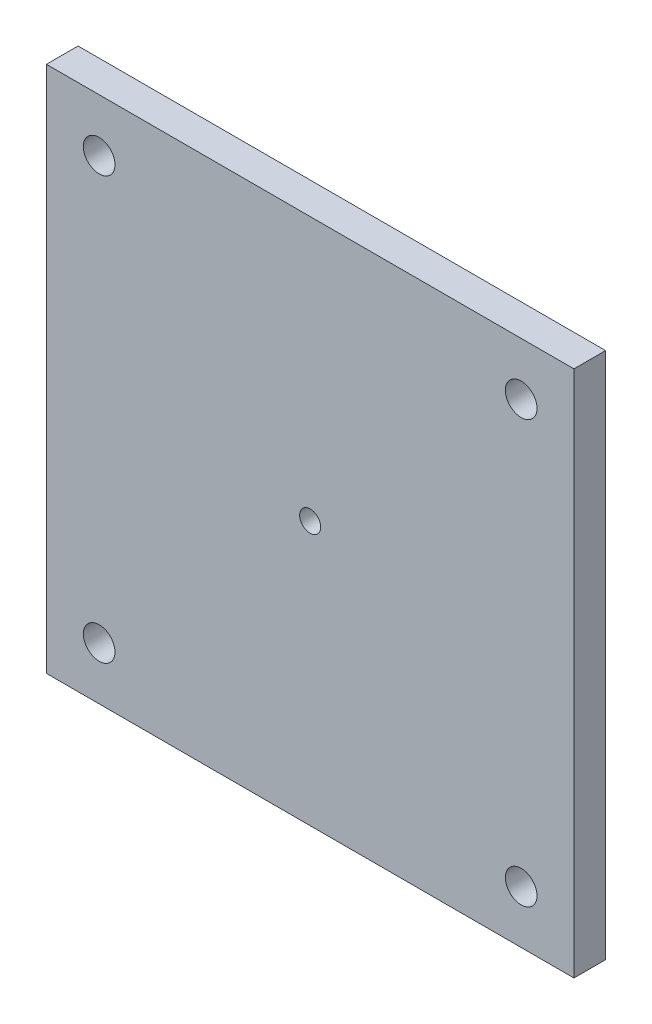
ISO-10303-21;
HEADER;
FILE_DESCRIPTION(('STEP AP214'),'2;1');
FILE_NAME('part.step','',(''),(''),'','','');
FILE_SCHEMA(('AUTOMOTIVE_DESIGN { 1 0 10303 214 1 1 1 1 }'));
ENDSEC;
DATA;
#1=APPLICATION_CONTEXT('core data for automotive mechanical design processes');
#2=APPLICATION_PROTOCOL_DEFINITION('international standard','automotive_design',2000,#1);
#3=PRODUCT_CONTEXT('',#1,'mechanical');
#4=PRODUCT('Part','Part','',(#3));
#5=PRODUCT_RELATED_PRODUCT_CATEGORY('part','',(#4));
#6=PRODUCT_DEFINITION_FORMATION('','',#4);
#7=PRODUCT_DEFINITION_CONTEXT('part definition',#1,'design');
#8=PRODUCT_DEFINITION('design','',#6,#7);
#9=PRODUCT_DEFINITION_SHAPE('','',#8);
#10=(LENGTH_UNIT() NAMED_UNIT(*) SI_UNIT(.MILLI.,.METRE.));
#11=(NAMED_UNIT(*) PLANE_ANGLE_UNIT() SI_UNIT($,.RADIAN.));
#12=(NAMED_UNIT(*) SI_UNIT($,.STERADIAN.) SOLID_ANGLE_UNIT());
#13=UNCERTAINTY_MEASURE_WITH_UNIT(LENGTH_MEASURE(1.E-05),#10,'distance_accuracy_value','');
#14=(GEOMETRIC_REPRESENTATION_CONTEXT(3) GLOBAL_UNCERTAINTY_ASSIGNED_CONTEXT((#13)) GLOBAL_UNIT_ASSIGNED_CONTEXT((#10,
#11,#12)) REPRESENTATION_CONTEXT('',''));
#15=CARTESIAN_POINT('',(0.,0.,0.));
#16=DIRECTION('',(0.,0.,1.));
#17=DIRECTION('',(1.,0.,0.));
#18=AXIS2_PLACEMENT_3D('',#15,#16,#17);
#19=CARTESIAN_POINT('',(0.,0.,3.));
#20=DIRECTION('',(0.,0.,-1.));
#21=DIRECTION('',(-1.,0.,0.));
#22=AXIS2_PLACEMENT_3D('',#19,#20,#21);
#23=PLANE('',#22);
#24=DIRECTION('',(0.,1.,0.));
#25=VECTOR('',#24,1.);
#26=CARTESIAN_POINT('',(25.,-25.,3.));
#27=LINE('',#26,#25);
#28=CARTESIAN_POINT('',(25.,-25.,3.));
#29=VERTEX_POINT('',#28);
#30=CARTESIAN_POINT('',(25.,25.,3.));
#31=VERTEX_POINT('',#30);
#32=EDGE_CURVE('E85',#29,#31,#27,.T.);
#33=ORIENTED_EDGE('',*,*,#32,.T.);
#34=DIRECTION('',(-1.,0.,0.));
#35=VECTOR('',#34,1.);
#36=CARTESIAN_POINT('',(-25.,25.,3.));
#37=LINE('',#36,#35);
#38=CARTESIAN_POINT('',(-25.,25.,3.));
#39=VERTEX_POINT('',#38);
#40=EDGE_CURVE('E80',#31,#39,#37,.T.);
#41=ORIENTED_EDGE('',*,*,#40,.T.);
#42=DIRECTION('',(0.,-1.,0.));
#43=VECTOR('',#42,1.);
#44=CARTESIAN_POINT('',(-25.,-25.,3.));
#45=LINE('',#44,#43);
#46=CARTESIAN_POINT('',(-25.,-25.,3.));
#47=VERTEX_POINT('',#46);
#48=EDGE_CURVE('E83',#39,#47,#45,.T.);
#49=ORIENTED_EDGE('',*,*,#48,.T.);
#50=DIRECTION('',(1.,0.,0.));
#51=VECTOR('',#50,1.);
#52=CARTESIAN_POINT('',(-25.,-25.,3.));
#53=LINE('',#52,#51);
#54=EDGE_CURVE('E50',#47,#29,#53,.T.);
#55=ORIENTED_EDGE('',*,*,#54,.T.);
#56=EDGE_LOOP('',(#33,#41,#49,#55));
#57=FACE_BOUND('',#56,.T.);
#58=CARTESIAN_POINT('',(-20.,20.,3.));
#59=DIRECTION('',(0.,0.,1.));
#60=DIRECTION('',(1.,0.,0.));
#61=AXIS2_PLACEMENT_3D('',#58,#59,#60);
#62=CIRCLE('',#61,1.5);
#63=CARTESIAN_POINT('',(-18.5,20.,3.));
#64=VERTEX_POINT('',#63);
#65=EDGE_CURVE('E100',#64,#64,#62,.T.);
#66=ORIENTED_EDGE('',*,*,#65,.F.);
#67=EDGE_LOOP('',(#66));
#68=FACE_BOUND('',#67,.T.);
#69=CARTESIAN_POINT('',(20.,20.,3.));
#70=DIRECTION('',(0.,0.,1.));
#71=DIRECTION('',(1.,0.,0.));
#72=AXIS2_PLACEMENT_3D('',#69,#70,#71);
#73=CIRCLE('',#72,1.5);
#74=CARTESIAN_POINT('',(21.5,20.,3.));
#75=VERTEX_POINT('',#74);
#76=EDGE_CURVE('E115',#75,#75,#73,.T.);
#77=ORIENTED_EDGE('',*,*,#76,.F.);
#78=EDGE_LOOP('',(#77));
#79=FACE_BOUND('',#78,.T.);
#80=CARTESIAN_POINT('',(20.,-20.,3.));
#81=DIRECTION('',(0.,0.,1.));
#82=DIRECTION('',(1.,0.,0.));
#83=AXIS2_PLACEMENT_3D('',#80,#81,#82);
#84=CIRCLE('',#83,1.5);
#85=CARTESIAN_POINT('',(21.5,-20.,3.));
#86=VERTEX_POINT('',#85);
#87=EDGE_CURVE('E121',#86,#86,#84,.T.);
#88=ORIENTED_EDGE('',*,*,#87,.F.);
#89=EDGE_LOOP('',(#88));
#90=FACE_BOUND('',#89,.T.);
#91=CARTESIAN_POINT('',(-20.,-20.,3.));
#92=DIRECTION('',(0.,0.,1.));
#93=DIRECTION('',(1.,0.,0.));
#94=AXIS2_PLACEMENT_3D('',#91,#92,#93);
#95=CIRCLE('',#94,1.5);
#96=CARTESIAN_POINT('',(-18.5,-20.,3.));
#97=VERTEX_POINT('',#96);
#98=EDGE_CURVE('E127',#97,#97,#95,.T.);
#99=ORIENTED_EDGE('',*,*,#98,.F.);
#100=EDGE_LOOP('',(#99));
#101=FACE_BOUND('',#100,.T.);
#102=CARTESIAN_POINT('',(0.,0.,3.));
#103=DIRECTION('',(0.,0.,1.));
#104=DIRECTION('',(1.,0.,0.));
#105=AXIS2_PLACEMENT_3D('',#102,#103,#104);
#106=CIRCLE('',#105,1.);
#107=CARTESIAN_POINT('',(0.99999999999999,0.,3.));
#108=VERTEX_POINT('',#107);
#109=EDGE_CURVE('E133',#108,#108,#106,.T.);
#110=ORIENTED_EDGE('',*,*,#109,.F.);
#111=EDGE_LOOP('',(#110));
#112=FACE_BOUND('',#111,.T.);
#113=ADVANCED_FACE('F33',(#57,#68,#79,#90,#101,#112),#23,.F.);
#114=CARTESIAN_POINT('',(0.,0.,0.));
#115=DIRECTION('',(0.,0.,-1.));
#116=DIRECTION('',(-1.,0.,0.));
#117=AXIS2_PLACEMENT_3D('',#114,#115,#116);
#118=PLANE('',#117);
#119=CARTESIAN_POINT('',(-20.,-20.,0.));
#120=DIRECTION('',(0.,0.,1.));
#121=DIRECTION('',(1.,0.,0.));
#122=AXIS2_PLACEMENT_3D('',#119,#120,#121);
#123=CIRCLE('',#122,1.5);
#124=CARTESIAN_POINT('',(-18.5,-20.,0.));
#125=VERTEX_POINT('',#124);
#126=EDGE_CURVE('E130',#125,#125,#123,.T.);
#127=ORIENTED_EDGE('',*,*,#126,.T.);
#128=EDGE_LOOP('',(#127));
#129=FACE_BOUND('',#128,.T.);
#130=CARTESIAN_POINT('',(20.,20.,0.));
#131=DIRECTION('',(0.,0.,1.));
#132=DIRECTION('',(1.,0.,0.));
#133=AXIS2_PLACEMENT_3D('',#130,#131,#132);
#134=CIRCLE('',#133,1.5);
#135=CARTESIAN_POINT('',(21.5,20.,0.));
#136=VERTEX_POINT('',#135);
#137=EDGE_CURVE('E118',#136,#136,#134,.T.);
#138=ORIENTED_EDGE('',*,*,#137,.T.);
#139=EDGE_LOOP('',(#138));
#140=FACE_BOUND('',#139,.T.);
#141=DIRECTION('',(0.,1.,0.));
#142=VECTOR('',#141,1.);
#143=CARTESIAN_POINT('',(25.,-25.,0.));
#144=LINE('',#143,#142);
#145=CARTESIAN_POINT('',(25.,-25.,0.));
#146=VERTEX_POINT('',#145);
#147=CARTESIAN_POINT('',(25.,25.,0.));
#148=VERTEX_POINT('',#147);
#149=EDGE_CURVE('E97',#146,#148,#144,.T.);
#150=ORIENTED_EDGE('',*,*,#149,.F.);
#151=DIRECTION('',(1.,0.,0.));
#152=VECTOR('',#151,1.);
#153=CARTESIAN_POINT('',(-25.,-25.,0.));
#154=LINE('',#153,#152);
#155=CARTESIAN_POINT('',(-25.,-25.,0.));
#156=VERTEX_POINT('',#155);
#157=EDGE_CURVE('E73',#156,#146,#154,.T.);
#158=ORIENTED_EDGE('',*,*,#157,.F.);
#159=DIRECTION('',(0.,-1.,0.));
#160=VECTOR('',#159,1.);
#161=CARTESIAN_POINT('',(-25.,-25.,0.));
#162=LINE('',#161,#160);
#163=CARTESIAN_POINT('',(-25.,25.,0.));
#164=VERTEX_POINT('',#163);
#165=EDGE_CURVE('E67',#164,#156,#162,.T.);
#166=ORIENTED_EDGE('',*,*,#165,.F.);
#167=DIRECTION('',(-1.,0.,0.));
#168=VECTOR('',#167,1.);
#169=CARTESIAN_POINT('',(-25.,25.,0.));
#170=LINE('',#169,#168);
#171=EDGE_CURVE('E89',#148,#164,#170,.T.);
#172=ORIENTED_EDGE('',*,*,#171,.F.);
#173=EDGE_LOOP('',(#150,#158,#166,#172));
#174=FACE_BOUND('',#173,.T.);
#175=CARTESIAN_POINT('',(-20.,20.,0.));
#176=DIRECTION('',(0.,0.,1.));
#177=DIRECTION('',(1.,0.,0.));
#178=AXIS2_PLACEMENT_3D('',#175,#176,#177);
#179=CIRCLE('',#178,1.5);
#180=CARTESIAN_POINT('',(-18.5,20.,0.));
#181=VERTEX_POINT('',#180);
#182=EDGE_CURVE('E112',#181,#181,#179,.T.);
#183=ORIENTED_EDGE('',*,*,#182,.T.);
#184=EDGE_LOOP('',(#183));
#185=FACE_BOUND('',#184,.T.);
#186=CARTESIAN_POINT('',(20.,-20.,0.));
#187=DIRECTION('',(0.,0.,1.));
#188=DIRECTION('',(1.,0.,0.));
#189=AXIS2_PLACEMENT_3D('',#186,#187,#188);
#190=CIRCLE('',#189,1.5);
#191=CARTESIAN_POINT('',(21.5,-20.,0.));
#192=VERTEX_POINT('',#191);
#193=EDGE_CURVE('E124',#192,#192,#190,.T.);
#194=ORIENTED_EDGE('',*,*,#193,.T.);
#195=EDGE_LOOP('',(#194));
#196=FACE_BOUND('',#195,.T.);
#197=CARTESIAN_POINT('',(0.,0.,0.));
#198=DIRECTION('',(0.,0.,1.));
#199=DIRECTION('',(1.,0.,0.));
#200=AXIS2_PLACEMENT_3D('',#197,#198,#199);
#201=CIRCLE('',#200,1.);
#202=CARTESIAN_POINT('',(0.99999999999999,0.,0.));
#203=VERTEX_POINT('',#202);
#204=EDGE_CURVE('E136',#203,#203,#201,.T.);
#205=ORIENTED_EDGE('',*,*,#204,.T.);
#206=EDGE_LOOP('',(#205));
#207=FACE_BOUND('',#206,.T.);
#208=ADVANCED_FACE('F108',(#129,#140,#174,#185,#196,#207),#118,.T.);
#209=CARTESIAN_POINT('',(25.,-25.,3.));
#210=DIRECTION('',(-1.,0.,0.));
#211=DIRECTION('',(0.,0.,1.));
#212=AXIS2_PLACEMENT_3D('',#209,#210,#211);
#213=PLANE('',#212);
#214=ORIENTED_EDGE('',*,*,#149,.T.);
#215=DIRECTION('',(0.,0.,-1.));
#216=VECTOR('',#215,1.);
#217=CARTESIAN_POINT('',(25.,25.,3.));
#218=LINE('',#217,#216);
#219=EDGE_CURVE('E11',#31,#148,#218,.T.);
#220=ORIENTED_EDGE('',*,*,#219,.F.);
#221=ORIENTED_EDGE('',*,*,#32,.F.);
#222=DIRECTION('',(0.,0.,-1.));
#223=VECTOR('',#222,1.);
#224=CARTESIAN_POINT('',(25.,-25.,3.));
#225=LINE('',#224,#223);
#226=EDGE_CURVE('E93',#29,#146,#225,.T.);
#227=ORIENTED_EDGE('',*,*,#226,.T.);
#228=EDGE_LOOP('',(#214,#220,#221,#227));
#229=FACE_BOUND('',#228,.T.);
#230=ADVANCED_FACE('F35',(#229),#213,.F.);
#231=CARTESIAN_POINT('',(-25.,25.,3.));
#232=DIRECTION('',(0.,-1.,0.));
#233=DIRECTION('',(0.,0.,-1.));
#234=AXIS2_PLACEMENT_3D('',#231,#232,#233);
#235=PLANE('',#234);
#236=ORIENTED_EDGE('',*,*,#171,.T.);
#237=DIRECTION('',(0.,0.,-1.));
#238=VECTOR('',#237,1.);
#239=CARTESIAN_POINT('',(-25.,25.,3.));
#240=LINE('',#239,#238);
#241=EDGE_CURVE('E42',#39,#164,#240,.T.);
#242=ORIENTED_EDGE('',*,*,#241,.F.);
#243=ORIENTED_EDGE('',*,*,#40,.F.);
#244=ORIENTED_EDGE('',*,*,#219,.T.);
#245=EDGE_LOOP('',(#236,#242,#243,#244));
#246=FACE_BOUND('',#245,.T.);
#247=ADVANCED_FACE('F88',(#246),#235,.F.);
#248=CARTESIAN_POINT('',(-25.,-25.,3.));
#249=DIRECTION('',(1.,0.,0.));
#250=DIRECTION('',(0.,0.,-1.));
#251=AXIS2_PLACEMENT_3D('',#248,#249,#250);
#252=PLANE('',#251);
#253=ORIENTED_EDGE('',*,*,#165,.T.);
#254=DIRECTION('',(0.,0.,-1.));
#255=VECTOR('',#254,1.);
#256=CARTESIAN_POINT('',(-25.,-25.,3.));
#257=LINE('',#256,#255);
#258=EDGE_CURVE('E90',#47,#156,#257,.T.);
#259=ORIENTED_EDGE('',*,*,#258,.F.);
#260=ORIENTED_EDGE('',*,*,#48,.F.);
#261=ORIENTED_EDGE('',*,*,#241,.T.);
#262=EDGE_LOOP('',(#253,#259,#260,#261));
#263=FACE_BOUND('',#262,.T.);
#264=ADVANCED_FACE('F91',(#263),#252,.F.);
#265=CARTESIAN_POINT('',(-25.,-25.,3.));
#266=DIRECTION('',(0.,1.,0.));
#267=DIRECTION('',(0.,0.,1.));
#268=AXIS2_PLACEMENT_3D('',#265,#266,#267);
#269=PLANE('',#268);
#270=ORIENTED_EDGE('',*,*,#157,.T.);
#271=ORIENTED_EDGE('',*,*,#226,.F.);
#272=ORIENTED_EDGE('',*,*,#54,.F.);
#273=ORIENTED_EDGE('',*,*,#258,.T.);
#274=EDGE_LOOP('',(#270,#271,#272,#273));
#275=FACE_BOUND('',#274,.T.);
#276=ADVANCED_FACE('F105',(#275),#269,.F.);
#277=CARTESIAN_POINT('',(-20.,20.,3.));
#278=DIRECTION('',(0.,0.,-1.));
#279=DIRECTION('',(-1.,0.,0.));
#280=AXIS2_PLACEMENT_3D('',#277,#278,#279);
#281=CYLINDRICAL_SURFACE('',#280,1.5);
#282=ORIENTED_EDGE('',*,*,#65,.T.);
#283=EDGE_LOOP('',(#282));
#284=FACE_BOUND('',#283,.T.);
#285=ORIENTED_EDGE('',*,*,#182,.F.);
#286=EDGE_LOOP('',(#285));
#287=FACE_BOUND('',#286,.T.);
#288=ADVANCED_FACE('F153',(#284,#287),#281,.F.);
#289=CARTESIAN_POINT('',(20.,20.,3.));
#290=DIRECTION('',(0.,0.,-1.));
#291=DIRECTION('',(-1.,0.,0.));
#292=AXIS2_PLACEMENT_3D('',#289,#290,#291);
#293=CYLINDRICAL_SURFACE('',#292,1.5);
#294=ORIENTED_EDGE('',*,*,#76,.T.);
#295=EDGE_LOOP('',(#294));
#296=FACE_BOUND('',#295,.T.);
#297=ORIENTED_EDGE('',*,*,#137,.F.);
#298=EDGE_LOOP('',(#297));
#299=FACE_BOUND('',#298,.T.);
#300=ADVANCED_FACE('F199',(#296,#299),#293,.F.);
#301=CARTESIAN_POINT('',(20.,-20.,3.));
#302=DIRECTION('',(0.,0.,-1.));
#303=DIRECTION('',(-1.,0.,0.));
#304=AXIS2_PLACEMENT_3D('',#301,#302,#303);
#305=CYLINDRICAL_SURFACE('',#304,1.5);
#306=ORIENTED_EDGE('',*,*,#87,.T.);
#307=EDGE_LOOP('',(#306));
#308=FACE_BOUND('',#307,.T.);
#309=ORIENTED_EDGE('',*,*,#193,.F.);
#310=EDGE_LOOP('',(#309));
#311=FACE_BOUND('',#310,.T.);
#312=ADVANCED_FACE('F207',(#308,#311),#305,.F.);
#313=CARTESIAN_POINT('',(-20.,-20.,3.));
#314=DIRECTION('',(0.,0.,-1.));
#315=DIRECTION('',(-1.,0.,0.));
#316=AXIS2_PLACEMENT_3D('',#313,#314,#315);
#317=CYLINDRICAL_SURFACE('',#316,1.5);
#318=ORIENTED_EDGE('',*,*,#98,.T.);
#319=EDGE_LOOP('',(#318));
#320=FACE_BOUND('',#319,.T.);
#321=ORIENTED_EDGE('',*,*,#126,.F.);
#322=EDGE_LOOP('',(#321));
#323=FACE_BOUND('',#322,.T.);
#324=ADVANCED_FACE('F215',(#320,#323),#317,.F.);
#325=CARTESIAN_POINT('',(0.,0.,3.));
#326=DIRECTION('',(0.,0.,-1.));
#327=DIRECTION('',(-1.,0.,0.));
#328=AXIS2_PLACEMENT_3D('',#325,#326,#327);
#329=CYLINDRICAL_SURFACE('',#328,1.);
#330=ORIENTED_EDGE('',*,*,#109,.T.);
#331=EDGE_LOOP('',(#330));
#332=FACE_BOUND('',#331,.T.);
#333=ORIENTED_EDGE('',*,*,#204,.F.);
#334=EDGE_LOOP('',(#333));
#335=FACE_BOUND('',#334,.T.);
#336=ADVANCED_FACE('F142',(#332,#335),#329,.F.);
#337=CLOSED_SHELL('',(#113,#208,#230,#247,#264,#276,#288,#300,#312,#324,#336));
#338=MANIFOLD_SOLID_BREP('B2',#337);
#339=ADVANCED_BREP_SHAPE_REPRESENTATION('',(#18,#338),#14);
#340=SHAPE_DEFINITION_REPRESENTATION(#9,#339);
ENDSEC;
END-ISO-10303-21;
